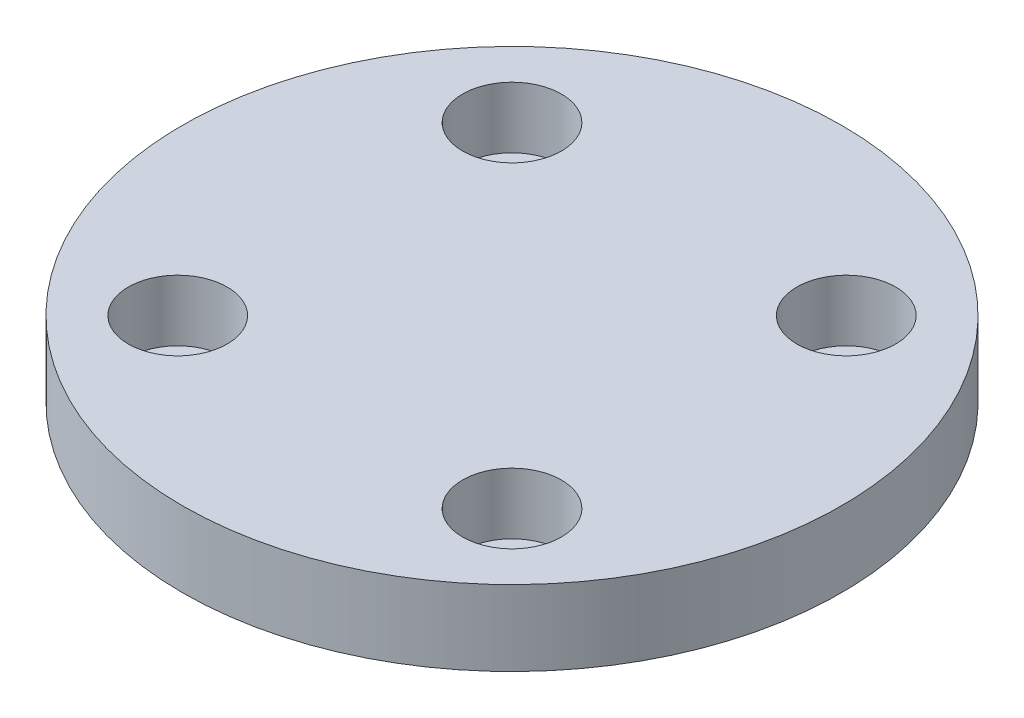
ISO-10303-21;
HEADER;
FILE_DESCRIPTION(('STEP AP214'),'2;1');
FILE_NAME('part.step','',(''),(''),'','','');
FILE_SCHEMA(('AUTOMOTIVE_DESIGN { 1 0 10303 214 1 1 1 1 }'));
ENDSEC;
DATA;
#1=APPLICATION_CONTEXT('core data for automotive mechanical design processes');
#2=APPLICATION_PROTOCOL_DEFINITION('international standard','automotive_design',2000,#1);
#3=PRODUCT_CONTEXT('',#1,'mechanical');
#4=PRODUCT('Part','Part','',(#3));
#5=PRODUCT_RELATED_PRODUCT_CATEGORY('part','',(#4));
#6=PRODUCT_DEFINITION_FORMATION('','',#4);
#7=PRODUCT_DEFINITION_CONTEXT('part definition',#1,'design');
#8=PRODUCT_DEFINITION('design','',#6,#7);
#9=PRODUCT_DEFINITION_SHAPE('','',#8);
#10=(LENGTH_UNIT() NAMED_UNIT(*) SI_UNIT(.MILLI.,.METRE.));
#11=(NAMED_UNIT(*) PLANE_ANGLE_UNIT() SI_UNIT($,.RADIAN.));
#12=(NAMED_UNIT(*) SI_UNIT($,.STERADIAN.) SOLID_ANGLE_UNIT());
#13=UNCERTAINTY_MEASURE_WITH_UNIT(LENGTH_MEASURE(1.E-05),#10,'distance_accuracy_value','');
#14=(GEOMETRIC_REPRESENTATION_CONTEXT(3) GLOBAL_UNCERTAINTY_ASSIGNED_CONTEXT((#13)) GLOBAL_UNIT_ASSIGNED_CONTEXT((#10,
#11,#12)) REPRESENTATION_CONTEXT('',''));
#15=CARTESIAN_POINT('',(0.,0.,0.));
#16=DIRECTION('',(0.,0.,1.));
#17=DIRECTION('',(1.,0.,0.));
#18=AXIS2_PLACEMENT_3D('',#15,#16,#17);
#19=CARTESIAN_POINT('',(0.,8.,0.));
#20=DIRECTION('',(0.,-1.,0.));
#21=DIRECTION('',(0.,0.,-1.));
#22=AXIS2_PLACEMENT_3D('',#19,#20,#21);
#23=CYLINDRICAL_SURFACE('',#22,35.);
#24=CARTESIAN_POINT('',(0.,8.,0.));
#25=DIRECTION('',(0.,1.,0.));
#26=DIRECTION('',(0.,0.,1.));
#27=AXIS2_PLACEMENT_3D('',#24,#25,#26);
#28=CIRCLE('',#27,35.);
#29=CARTESIAN_POINT('',(0.,8.,35.));
#30=VERTEX_POINT('',#29);
#31=EDGE_CURVE('E10',#30,#30,#28,.T.);
#32=ORIENTED_EDGE('',*,*,#31,.F.);
#33=EDGE_LOOP('',(#32));
#34=FACE_BOUND('',#33,.T.);
#35=CARTESIAN_POINT('',(0.,0.,0.));
#36=DIRECTION('',(0.,1.,0.));
#37=DIRECTION('',(0.,0.,1.));
#38=AXIS2_PLACEMENT_3D('',#35,#36,#37);
#39=CIRCLE('',#38,35.);
#40=CARTESIAN_POINT('',(0.,0.,35.));
#41=VERTEX_POINT('',#40);
#42=EDGE_CURVE('E36',#41,#41,#39,.T.);
#43=ORIENTED_EDGE('',*,*,#42,.T.);
#44=EDGE_LOOP('',(#43));
#45=FACE_BOUND('',#44,.T.);
#46=ADVANCED_FACE('F33',(#34,#45),#23,.T.);
#47=CARTESIAN_POINT('',(0.,8.,0.));
#48=DIRECTION('',(0.,1.,0.));
#49=DIRECTION('',(0.,0.,1.));
#50=AXIS2_PLACEMENT_3D('',#47,#48,#49);
#51=PLANE('',#50);
#52=CARTESIAN_POINT('',(-17.75,8.,17.75));
#53=DIRECTION('',(0.,1.,0.));
#54=DIRECTION('',(0.,0.,1.));
#55=AXIS2_PLACEMENT_3D('',#52,#53,#54);
#56=CIRCLE('',#55,5.25);
#57=CARTESIAN_POINT('',(-17.75,8.,23.));
#58=VERTEX_POINT('',#57);
#59=EDGE_CURVE('E63',#58,#58,#56,.T.);
#60=ORIENTED_EDGE('',*,*,#59,.F.);
#61=EDGE_LOOP('',(#60));
#62=FACE_BOUND('',#61,.T.);
#63=CARTESIAN_POINT('',(17.75,8.,17.75));
#64=DIRECTION('',(0.,1.,0.));
#65=DIRECTION('',(0.,0.,1.));
#66=AXIS2_PLACEMENT_3D('',#63,#64,#65);
#67=CIRCLE('',#66,5.25);
#68=CARTESIAN_POINT('',(17.75,8.,23.));
#69=VERTEX_POINT('',#68);
#70=EDGE_CURVE('E57',#69,#69,#67,.T.);
#71=ORIENTED_EDGE('',*,*,#70,.F.);
#72=EDGE_LOOP('',(#71));
#73=FACE_BOUND('',#72,.T.);
#74=CARTESIAN_POINT('',(17.75,8.,-17.75));
#75=DIRECTION('',(0.,1.,0.));
#76=DIRECTION('',(0.,0.,1.));
#77=AXIS2_PLACEMENT_3D('',#74,#75,#76);
#78=CIRCLE('',#77,5.25);
#79=CARTESIAN_POINT('',(17.75,8.,-12.5));
#80=VERTEX_POINT('',#79);
#81=EDGE_CURVE('E51',#80,#80,#78,.T.);
#82=ORIENTED_EDGE('',*,*,#81,.F.);
#83=EDGE_LOOP('',(#82));
#84=FACE_BOUND('',#83,.T.);
#85=CARTESIAN_POINT('',(-17.75,8.,-17.75));
#86=DIRECTION('',(0.,1.,0.));
#87=DIRECTION('',(0.,0.,1.));
#88=AXIS2_PLACEMENT_3D('',#85,#86,#87);
#89=CIRCLE('',#88,5.25);
#90=CARTESIAN_POINT('',(-17.75,8.,-12.5));
#91=VERTEX_POINT('',#90);
#92=EDGE_CURVE('E45',#91,#91,#89,.T.);
#93=ORIENTED_EDGE('',*,*,#92,.F.);
#94=EDGE_LOOP('',(#93));
#95=FACE_BOUND('',#94,.T.);
#96=ORIENTED_EDGE('',*,*,#31,.T.);
#97=EDGE_LOOP('',(#96));
#98=FACE_BOUND('',#97,.T.);
#99=ADVANCED_FACE('F110',(#62,#73,#84,#95,#98),#51,.T.);
#100=CARTESIAN_POINT('',(0.,0.,0.));
#101=DIRECTION('',(0.,1.,0.));
#102=DIRECTION('',(0.,0.,1.));
#103=AXIS2_PLACEMENT_3D('',#100,#101,#102);
#104=PLANE('',#103);
#105=CARTESIAN_POINT('',(17.75,0.,17.75));
#106=DIRECTION('',(0.,1.,0.));
#107=DIRECTION('',(0.,0.,1.));
#108=AXIS2_PLACEMENT_3D('',#105,#106,#107);
#109=CIRCLE('',#108,3.25);
#110=CARTESIAN_POINT('',(17.75,0.,21.));
#111=VERTEX_POINT('',#110);
#112=EDGE_CURVE('E86',#111,#111,#109,.T.);
#113=ORIENTED_EDGE('',*,*,#112,.T.);
#114=EDGE_LOOP('',(#113));
#115=FACE_BOUND('',#114,.T.);
#116=CARTESIAN_POINT('',(-17.75,0.,17.75));
#117=DIRECTION('',(0.,1.,0.));
#118=DIRECTION('',(0.,0.,1.));
#119=AXIS2_PLACEMENT_3D('',#116,#117,#118);
#120=CIRCLE('',#119,3.25);
#121=CARTESIAN_POINT('',(-17.75,0.,21.));
#122=VERTEX_POINT('',#121);
#123=EDGE_CURVE('E80',#122,#122,#120,.T.);
#124=ORIENTED_EDGE('',*,*,#123,.T.);
#125=EDGE_LOOP('',(#124));
#126=FACE_BOUND('',#125,.T.);
#127=CARTESIAN_POINT('',(-17.75,0.,-17.75));
#128=DIRECTION('',(0.,1.,0.));
#129=DIRECTION('',(0.,0.,1.));
#130=AXIS2_PLACEMENT_3D('',#127,#128,#129);
#131=CIRCLE('',#130,3.25);
#132=CARTESIAN_POINT('',(-17.75,0.,-14.5));
#133=VERTEX_POINT('',#132);
#134=EDGE_CURVE('E74',#133,#133,#131,.T.);
#135=ORIENTED_EDGE('',*,*,#134,.T.);
#136=EDGE_LOOP('',(#135));
#137=FACE_BOUND('',#136,.T.);
#138=CARTESIAN_POINT('',(17.75,0.,-17.75));
#139=DIRECTION('',(0.,1.,0.));
#140=DIRECTION('',(0.,0.,1.));
#141=AXIS2_PLACEMENT_3D('',#138,#139,#140);
#142=CIRCLE('',#141,3.25);
#143=CARTESIAN_POINT('',(17.75,0.,-14.5));
#144=VERTEX_POINT('',#143);
#145=EDGE_CURVE('E66',#144,#144,#142,.T.);
#146=ORIENTED_EDGE('',*,*,#145,.T.);
#147=EDGE_LOOP('',(#146));
#148=FACE_BOUND('',#147,.T.);
#149=ORIENTED_EDGE('',*,*,#42,.F.);
#150=EDGE_LOOP('',(#149));
#151=FACE_BOUND('',#150,.T.);
#152=ADVANCED_FACE('F113',(#115,#126,#137,#148,#151),#104,.F.);
#153=CARTESIAN_POINT('',(-17.75,1.5,-17.75));
#154=DIRECTION('',(0.,1.,0.));
#155=DIRECTION('',(0.,0.,1.));
#156=AXIS2_PLACEMENT_3D('',#153,#154,#155);
#157=CYLINDRICAL_SURFACE('',#156,5.25);
#158=CARTESIAN_POINT('',(-17.75,1.5,-17.75));
#159=DIRECTION('',(0.,1.,0.));
#160=DIRECTION('',(0.,0.,1.));
#161=AXIS2_PLACEMENT_3D('',#158,#159,#160);
#162=CIRCLE('',#161,5.25);
#163=CARTESIAN_POINT('',(-17.75,1.5,-12.5));
#164=VERTEX_POINT('',#163);
#165=EDGE_CURVE('E43',#164,#164,#162,.T.);
#166=CARTESIAN_POINT('',(-17.75,1.5,-12.5));
#167=CARTESIAN_POINT('',(-17.75,1.56770833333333,-12.5));
#168=CARTESIAN_POINT('',(-17.75,1.63541666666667,-12.5));
#169=CARTESIAN_POINT('',(-17.75,1.77083333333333,-12.5));
#170=CARTESIAN_POINT('',(-17.75,1.83854166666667,-12.5));
#171=CARTESIAN_POINT('',(-17.75,1.97395833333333,-12.5));
#172=CARTESIAN_POINT('',(-17.75,2.04166666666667,-12.5));
#173=CARTESIAN_POINT('',(-17.75,2.17708333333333,-12.5));
#174=CARTESIAN_POINT('',(-17.75,2.24479166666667,-12.5));
#175=CARTESIAN_POINT('',(-17.75,2.38020833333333,-12.5));
#176=CARTESIAN_POINT('',(-17.75,2.44791666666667,-12.5));
#177=CARTESIAN_POINT('',(-17.75,2.58333333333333,-12.5));
#178=CARTESIAN_POINT('',(-17.75,2.65104166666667,-12.5));
#179=CARTESIAN_POINT('',(-17.75,2.78645833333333,-12.5));
#180=CARTESIAN_POINT('',(-17.75,2.85416666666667,-12.5));
#181=CARTESIAN_POINT('',(-17.75,2.98958333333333,-12.5));
#182=CARTESIAN_POINT('',(-17.75,3.05729166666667,-12.5));
#183=CARTESIAN_POINT('',(-17.75,3.19270833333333,-12.5));
#184=CARTESIAN_POINT('',(-17.75,3.26041666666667,-12.5));
#185=CARTESIAN_POINT('',(-17.75,3.39583333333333,-12.5));
#186=CARTESIAN_POINT('',(-17.75,3.46354166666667,-12.5));
#187=CARTESIAN_POINT('',(-17.75,3.59895833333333,-12.5));
#188=CARTESIAN_POINT('',(-17.75,3.66666666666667,-12.5));
#189=CARTESIAN_POINT('',(-17.75,3.80208333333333,-12.5));
#190=CARTESIAN_POINT('',(-17.75,3.86979166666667,-12.5));
#191=CARTESIAN_POINT('',(-17.75,4.00520833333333,-12.5));
#192=CARTESIAN_POINT('',(-17.75,4.07291666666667,-12.5));
#193=CARTESIAN_POINT('',(-17.75,4.20833333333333,-12.5));
#194=CARTESIAN_POINT('',(-17.75,4.27604166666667,-12.5));
#195=CARTESIAN_POINT('',(-17.75,4.41145833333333,-12.5));
#196=CARTESIAN_POINT('',(-17.75,4.47916666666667,-12.5));
#197=CARTESIAN_POINT('',(-17.75,4.61458333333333,-12.5));
#198=CARTESIAN_POINT('',(-17.75,4.68229166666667,-12.5));
#199=CARTESIAN_POINT('',(-17.75,4.81770833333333,-12.5));
#200=CARTESIAN_POINT('',(-17.75,4.88541666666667,-12.5));
#201=CARTESIAN_POINT('',(-17.75,5.02083333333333,-12.5));
#202=CARTESIAN_POINT('',(-17.75,5.08854166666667,-12.5));
#203=CARTESIAN_POINT('',(-17.75,5.22395833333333,-12.5));
#204=CARTESIAN_POINT('',(-17.75,5.29166666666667,-12.5));
#205=CARTESIAN_POINT('',(-17.75,5.42708333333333,-12.5));
#206=CARTESIAN_POINT('',(-17.75,5.49479166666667,-12.5));
#207=CARTESIAN_POINT('',(-17.75,5.63020833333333,-12.5));
#208=CARTESIAN_POINT('',(-17.75,5.69791666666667,-12.5));
#209=CARTESIAN_POINT('',(-17.75,5.83333333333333,-12.5));
#210=CARTESIAN_POINT('',(-17.75,5.90104166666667,-12.5));
#211=CARTESIAN_POINT('',(-17.75,6.03645833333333,-12.5));
#212=CARTESIAN_POINT('',(-17.75,6.10416666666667,-12.5));
#213=CARTESIAN_POINT('',(-17.75,6.23958333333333,-12.5));
#214=CARTESIAN_POINT('',(-17.75,6.30729166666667,-12.5));
#215=CARTESIAN_POINT('',(-17.75,6.44270833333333,-12.5));
#216=CARTESIAN_POINT('',(-17.75,6.51041666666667,-12.5));
#217=CARTESIAN_POINT('',(-17.75,6.64583333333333,-12.5));
#218=CARTESIAN_POINT('',(-17.75,6.71354166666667,-12.5));
#219=CARTESIAN_POINT('',(-17.75,6.84895833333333,-12.5));
#220=CARTESIAN_POINT('',(-17.75,6.91666666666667,-12.5));
#221=CARTESIAN_POINT('',(-17.75,7.05208333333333,-12.5));
#222=CARTESIAN_POINT('',(-17.75,7.11979166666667,-12.5));
#223=CARTESIAN_POINT('',(-17.75,7.25520833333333,-12.5));
#224=CARTESIAN_POINT('',(-17.75,7.32291666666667,-12.5));
#225=CARTESIAN_POINT('',(-17.75,7.45833333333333,-12.5));
#226=CARTESIAN_POINT('',(-17.75,7.52604166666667,-12.5));
#227=CARTESIAN_POINT('',(-17.75,7.66145833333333,-12.5));
#228=CARTESIAN_POINT('',(-17.75,7.72916666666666,-12.5));
#229=CARTESIAN_POINT('',(-17.75,7.86458333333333,-12.5));
#230=CARTESIAN_POINT('',(-17.75,7.93229166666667,-12.5));
#231=CARTESIAN_POINT('',(-17.75,8.,-12.5));
#232=B_SPLINE_CURVE_WITH_KNOTS('',3,(#166,#167,#168,#169,#170,#171,#172,#173,#174,#175,#176,
#177,#178,#179,#180,#181,#182,#183,#184,#185,#186,#187,#188,#189,#190,#191,#192,#193,#194,#195,
#196,#197,#198,#199,#200,#201,#202,#203,#204,#205,#206,#207,#208,#209,#210,#211,#212,#213,#214,
#215,#216,#217,#218,#219,#220,#221,#222,#223,#224,#225,#226,#227,#228,#229,#230,#231),
.UNSPECIFIED.,.F.,.F.,(4,2,2,2,2,2,2,2,2,2,2,2,2,2,2,2,2,2,2,2,2,2,2,2,2,2,2,2,2,2,2,2,4),(0.,
0.203125,0.40625,0.609375,0.8125,1.015625,1.21875,1.421875,1.625,1.828125,2.03125,2.234375,
2.4375,2.640625,2.84375,3.046875,3.25,3.453125,3.65625,3.859375,4.0625,4.265625,4.46875,
4.671875,4.875,5.078125,5.28125,5.484375,5.6875,5.890625,6.09375,6.296875,6.5),.UNSPECIFIED.);
#233=EDGE_CURVE('BSEAM120',#164,#91,#232,.T.);
#234=ORIENTED_EDGE('',*,*,#165,.F.);
#235=ORIENTED_EDGE('',*,*,#92,.T.);
#236=ORIENTED_EDGE('',*,*,#233,.T.);
#237=ORIENTED_EDGE('',*,*,#233,.F.);
#238=EDGE_LOOP('',(#234,#236,#235,#237));
#239=FACE_BOUND('',#238,.T.);
#240=ADVANCED_FACE('F120',(#239),#157,.F.);
#241=CARTESIAN_POINT('',(-17.75,1.5,-17.75));
#242=DIRECTION('',(0.,1.,0.));
#243=DIRECTION('',(0.,0.,1.));
#244=AXIS2_PLACEMENT_3D('',#241,#242,#243);
#245=PLANE('',#244);
#246=CARTESIAN_POINT('',(-17.75,1.5,-17.75));
#247=DIRECTION('',(0.,1.,0.));
#248=DIRECTION('',(0.,0.,1.));
#249=AXIS2_PLACEMENT_3D('',#246,#247,#248);
#250=CIRCLE('',#249,3.25);
#251=CARTESIAN_POINT('',(-17.75,1.5,-14.5));
#252=VERTEX_POINT('',#251);
#253=EDGE_CURVE('E77',#252,#252,#250,.T.);
#254=ORIENTED_EDGE('',*,*,#253,.F.);
#255=EDGE_LOOP('',(#254));
#256=FACE_BOUND('',#255,.T.);
#257=ORIENTED_EDGE('',*,*,#165,.T.);
#258=EDGE_LOOP('',(#257));
#259=FACE_BOUND('',#258,.T.);
#260=ADVANCED_FACE('F122',(#256,#259),#245,.T.);
#261=CARTESIAN_POINT('',(17.75,1.5,-17.75));
#262=DIRECTION('',(0.,1.,0.));
#263=DIRECTION('',(0.,0.,1.));
#264=AXIS2_PLACEMENT_3D('',#261,#262,#263);
#265=CYLINDRICAL_SURFACE('',#264,5.25);
#266=CARTESIAN_POINT('',(17.75,1.5,-17.75));
#267=DIRECTION('',(0.,1.,0.));
#268=DIRECTION('',(0.,0.,1.));
#269=AXIS2_PLACEMENT_3D('',#266,#267,#268);
#270=CIRCLE('',#269,5.25);
#271=CARTESIAN_POINT('',(17.75,1.5,-12.5));
#272=VERTEX_POINT('',#271);
#273=EDGE_CURVE('E48',#272,#272,#270,.T.);
#274=CARTESIAN_POINT('',(17.75,1.5,-12.5));
#275=CARTESIAN_POINT('',(17.75,1.56770833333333,-12.5));
#276=CARTESIAN_POINT('',(17.75,1.63541666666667,-12.5));
#277=CARTESIAN_POINT('',(17.75,1.77083333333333,-12.5));
#278=CARTESIAN_POINT('',(17.75,1.83854166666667,-12.5));
#279=CARTESIAN_POINT('',(17.75,1.97395833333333,-12.5));
#280=CARTESIAN_POINT('',(17.75,2.04166666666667,-12.5));
#281=CARTESIAN_POINT('',(17.75,2.17708333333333,-12.5));
#282=CARTESIAN_POINT('',(17.75,2.24479166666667,-12.5));
#283=CARTESIAN_POINT('',(17.75,2.38020833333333,-12.5));
#284=CARTESIAN_POINT('',(17.75,2.44791666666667,-12.5));
#285=CARTESIAN_POINT('',(17.75,2.58333333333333,-12.5));
#286=CARTESIAN_POINT('',(17.75,2.65104166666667,-12.5));
#287=CARTESIAN_POINT('',(17.75,2.78645833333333,-12.5));
#288=CARTESIAN_POINT('',(17.75,2.85416666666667,-12.5));
#289=CARTESIAN_POINT('',(17.75,2.98958333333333,-12.5));
#290=CARTESIAN_POINT('',(17.75,3.05729166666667,-12.5));
#291=CARTESIAN_POINT('',(17.75,3.19270833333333,-12.5));
#292=CARTESIAN_POINT('',(17.75,3.26041666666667,-12.5));
#293=CARTESIAN_POINT('',(17.75,3.39583333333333,-12.5));
#294=CARTESIAN_POINT('',(17.75,3.46354166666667,-12.5));
#295=CARTESIAN_POINT('',(17.75,3.59895833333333,-12.5));
#296=CARTESIAN_POINT('',(17.75,3.66666666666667,-12.5));
#297=CARTESIAN_POINT('',(17.75,3.80208333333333,-12.5));
#298=CARTESIAN_POINT('',(17.75,3.86979166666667,-12.5));
#299=CARTESIAN_POINT('',(17.75,4.00520833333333,-12.5));
#300=CARTESIAN_POINT('',(17.75,4.07291666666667,-12.5));
#301=CARTESIAN_POINT('',(17.75,4.20833333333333,-12.5));
#302=CARTESIAN_POINT('',(17.75,4.27604166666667,-12.5));
#303=CARTESIAN_POINT('',(17.75,4.41145833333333,-12.5));
#304=CARTESIAN_POINT('',(17.75,4.47916666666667,-12.5));
#305=CARTESIAN_POINT('',(17.75,4.61458333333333,-12.5));
#306=CARTESIAN_POINT('',(17.75,4.68229166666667,-12.5));
#307=CARTESIAN_POINT('',(17.75,4.81770833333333,-12.5));
#308=CARTESIAN_POINT('',(17.75,4.88541666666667,-12.5));
#309=CARTESIAN_POINT('',(17.75,5.02083333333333,-12.5));
#310=CARTESIAN_POINT('',(17.75,5.08854166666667,-12.5));
#311=CARTESIAN_POINT('',(17.75,5.22395833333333,-12.5));
#312=CARTESIAN_POINT('',(17.75,5.29166666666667,-12.5));
#313=CARTESIAN_POINT('',(17.75,5.42708333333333,-12.5));
#314=CARTESIAN_POINT('',(17.75,5.49479166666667,-12.5));
#315=CARTESIAN_POINT('',(17.75,5.63020833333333,-12.5));
#316=CARTESIAN_POINT('',(17.75,5.69791666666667,-12.5));
#317=CARTESIAN_POINT('',(17.75,5.83333333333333,-12.5));
#318=CARTESIAN_POINT('',(17.75,5.90104166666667,-12.5));
#319=CARTESIAN_POINT('',(17.75,6.03645833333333,-12.5));
#320=CARTESIAN_POINT('',(17.75,6.10416666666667,-12.5));
#321=CARTESIAN_POINT('',(17.75,6.23958333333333,-12.5));
#322=CARTESIAN_POINT('',(17.75,6.30729166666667,-12.5));
#323=CARTESIAN_POINT('',(17.75,6.44270833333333,-12.5));
#324=CARTESIAN_POINT('',(17.75,6.51041666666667,-12.5));
#325=CARTESIAN_POINT('',(17.75,6.64583333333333,-12.5));
#326=CARTESIAN_POINT('',(17.75,6.71354166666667,-12.5));
#327=CARTESIAN_POINT('',(17.75,6.84895833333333,-12.5));
#328=CARTESIAN_POINT('',(17.75,6.91666666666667,-12.5));
#329=CARTESIAN_POINT('',(17.75,7.05208333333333,-12.5));
#330=CARTESIAN_POINT('',(17.75,7.11979166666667,-12.5));
#331=CARTESIAN_POINT('',(17.75,7.25520833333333,-12.5));
#332=CARTESIAN_POINT('',(17.75,7.32291666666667,-12.5));
#333=CARTESIAN_POINT('',(17.75,7.45833333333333,-12.5));
#334=CARTESIAN_POINT('',(17.75,7.52604166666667,-12.5));
#335=CARTESIAN_POINT('',(17.75,7.66145833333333,-12.5));
#336=CARTESIAN_POINT('',(17.75,7.72916666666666,-12.5));
#337=CARTESIAN_POINT('',(17.75,7.86458333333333,-12.5));
#338=CARTESIAN_POINT('',(17.75,7.93229166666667,-12.5));
#339=CARTESIAN_POINT('',(17.75,8.,-12.5));
#340=B_SPLINE_CURVE_WITH_KNOTS('',3,(#274,#275,#276,#277,#278,#279,#280,#281,#282,#283,#284,
#285,#286,#287,#288,#289,#290,#291,#292,#293,#294,#295,#296,#297,#298,#299,#300,#301,#302,#303,
#304,#305,#306,#307,#308,#309,#310,#311,#312,#313,#314,#315,#316,#317,#318,#319,#320,#321,#322,
#323,#324,#325,#326,#327,#328,#329,#330,#331,#332,#333,#334,#335,#336,#337,#338,#339),
.UNSPECIFIED.,.F.,.F.,(4,2,2,2,2,2,2,2,2,2,2,2,2,2,2,2,2,2,2,2,2,2,2,2,2,2,2,2,2,2,2,2,4),(0.,
0.203125,0.40625,0.609375,0.8125,1.015625,1.21875,1.421875,1.625,1.828125,2.03125,2.234375,
2.4375,2.640625,2.84375,3.046875,3.25,3.453125,3.65625,3.859375,4.0625,4.265625,4.46875,
4.671875,4.875,5.078125,5.28125,5.484375,5.6875,5.890625,6.09375,6.296875,6.5),.UNSPECIFIED.);
#341=EDGE_CURVE('BSEAM129',#272,#80,#340,.T.);
#342=ORIENTED_EDGE('',*,*,#273,.F.);
#343=ORIENTED_EDGE('',*,*,#81,.T.);
#344=ORIENTED_EDGE('',*,*,#341,.T.);
#345=ORIENTED_EDGE('',*,*,#341,.F.);
#346=EDGE_LOOP('',(#342,#344,#343,#345));
#347=FACE_BOUND('',#346,.T.);
#348=ADVANCED_FACE('F129',(#347),#265,.F.);
#349=CARTESIAN_POINT('',(17.75,1.5,-17.75));
#350=DIRECTION('',(0.,1.,0.));
#351=DIRECTION('',(0.,0.,1.));
#352=AXIS2_PLACEMENT_3D('',#349,#350,#351);
#353=PLANE('',#352);
#354=CARTESIAN_POINT('',(17.75,1.5,-17.75));
#355=DIRECTION('',(0.,1.,0.));
#356=DIRECTION('',(0.,0.,1.));
#357=AXIS2_PLACEMENT_3D('',#354,#355,#356);
#358=CIRCLE('',#357,3.25);
#359=CARTESIAN_POINT('',(17.75,1.5,-14.5));
#360=VERTEX_POINT('',#359);
#361=EDGE_CURVE('E71',#360,#360,#358,.T.);
#362=ORIENTED_EDGE('',*,*,#361,.F.);
#363=EDGE_LOOP('',(#362));
#364=FACE_BOUND('',#363,.T.);
#365=ORIENTED_EDGE('',*,*,#273,.T.);
#366=EDGE_LOOP('',(#365));
#367=FACE_BOUND('',#366,.T.);
#368=ADVANCED_FACE('F106',(#364,#367),#353,.T.);
#369=CARTESIAN_POINT('',(17.75,1.5,17.75));
#370=DIRECTION('',(0.,1.,0.));
#371=DIRECTION('',(0.,0.,1.));
#372=AXIS2_PLACEMENT_3D('',#369,#370,#371);
#373=CYLINDRICAL_SURFACE('',#372,5.25);
#374=CARTESIAN_POINT('',(17.75,1.5,17.75));
#375=DIRECTION('',(0.,1.,0.));
#376=DIRECTION('',(0.,0.,1.));
#377=AXIS2_PLACEMENT_3D('',#374,#375,#376);
#378=CIRCLE('',#377,5.25);
#379=CARTESIAN_POINT('',(17.75,1.5,23.));
#380=VERTEX_POINT('',#379);
#381=EDGE_CURVE('E54',#380,#380,#378,.T.);
#382=CARTESIAN_POINT('',(17.75,1.5,23.));
#383=CARTESIAN_POINT('',(17.75,1.56770833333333,23.));
#384=CARTESIAN_POINT('',(17.75,1.63541666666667,23.));
#385=CARTESIAN_POINT('',(17.75,1.77083333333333,23.));
#386=CARTESIAN_POINT('',(17.75,1.83854166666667,23.));
#387=CARTESIAN_POINT('',(17.75,1.97395833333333,23.));
#388=CARTESIAN_POINT('',(17.75,2.04166666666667,23.));
#389=CARTESIAN_POINT('',(17.75,2.17708333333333,23.));
#390=CARTESIAN_POINT('',(17.75,2.24479166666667,23.));
#391=CARTESIAN_POINT('',(17.75,2.38020833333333,23.));
#392=CARTESIAN_POINT('',(17.75,2.44791666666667,23.));
#393=CARTESIAN_POINT('',(17.75,2.58333333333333,23.));
#394=CARTESIAN_POINT('',(17.75,2.65104166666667,23.));
#395=CARTESIAN_POINT('',(17.75,2.78645833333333,23.));
#396=CARTESIAN_POINT('',(17.75,2.85416666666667,23.));
#397=CARTESIAN_POINT('',(17.75,2.98958333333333,23.));
#398=CARTESIAN_POINT('',(17.75,3.05729166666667,23.));
#399=CARTESIAN_POINT('',(17.75,3.19270833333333,23.));
#400=CARTESIAN_POINT('',(17.75,3.26041666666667,23.));
#401=CARTESIAN_POINT('',(17.75,3.39583333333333,23.));
#402=CARTESIAN_POINT('',(17.75,3.46354166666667,23.));
#403=CARTESIAN_POINT('',(17.75,3.59895833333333,23.));
#404=CARTESIAN_POINT('',(17.75,3.66666666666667,23.));
#405=CARTESIAN_POINT('',(17.75,3.80208333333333,23.));
#406=CARTESIAN_POINT('',(17.75,3.86979166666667,23.));
#407=CARTESIAN_POINT('',(17.75,4.00520833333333,23.));
#408=CARTESIAN_POINT('',(17.75,4.07291666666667,23.));
#409=CARTESIAN_POINT('',(17.75,4.20833333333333,23.));
#410=CARTESIAN_POINT('',(17.75,4.27604166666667,23.));
#411=CARTESIAN_POINT('',(17.75,4.41145833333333,23.));
#412=CARTESIAN_POINT('',(17.75,4.47916666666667,23.));
#413=CARTESIAN_POINT('',(17.75,4.61458333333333,23.));
#414=CARTESIAN_POINT('',(17.75,4.68229166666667,23.));
#415=CARTESIAN_POINT('',(17.75,4.81770833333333,23.));
#416=CARTESIAN_POINT('',(17.75,4.88541666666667,23.));
#417=CARTESIAN_POINT('',(17.75,5.02083333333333,23.));
#418=CARTESIAN_POINT('',(17.75,5.08854166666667,23.));
#419=CARTESIAN_POINT('',(17.75,5.22395833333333,23.));
#420=CARTESIAN_POINT('',(17.75,5.29166666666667,23.));
#421=CARTESIAN_POINT('',(17.75,5.42708333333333,23.));
#422=CARTESIAN_POINT('',(17.75,5.49479166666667,23.));
#423=CARTESIAN_POINT('',(17.75,5.63020833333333,23.));
#424=CARTESIAN_POINT('',(17.75,5.69791666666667,23.));
#425=CARTESIAN_POINT('',(17.75,5.83333333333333,23.));
#426=CARTESIAN_POINT('',(17.75,5.90104166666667,23.));
#427=CARTESIAN_POINT('',(17.75,6.03645833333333,23.));
#428=CARTESIAN_POINT('',(17.75,6.10416666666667,23.));
#429=CARTESIAN_POINT('',(17.75,6.23958333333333,23.));
#430=CARTESIAN_POINT('',(17.75,6.30729166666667,23.));
#431=CARTESIAN_POINT('',(17.75,6.44270833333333,23.));
#432=CARTESIAN_POINT('',(17.75,6.51041666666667,23.));
#433=CARTESIAN_POINT('',(17.75,6.64583333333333,23.));
#434=CARTESIAN_POINT('',(17.75,6.71354166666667,23.));
#435=CARTESIAN_POINT('',(17.75,6.84895833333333,23.));
#436=CARTESIAN_POINT('',(17.75,6.91666666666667,23.));
#437=CARTESIAN_POINT('',(17.75,7.05208333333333,23.));
#438=CARTESIAN_POINT('',(17.75,7.11979166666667,23.));
#439=CARTESIAN_POINT('',(17.75,7.25520833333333,23.));
#440=CARTESIAN_POINT('',(17.75,7.32291666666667,23.));
#441=CARTESIAN_POINT('',(17.75,7.45833333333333,23.));
#442=CARTESIAN_POINT('',(17.75,7.52604166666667,23.));
#443=CARTESIAN_POINT('',(17.75,7.66145833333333,23.));
#444=CARTESIAN_POINT('',(17.75,7.72916666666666,23.));
#445=CARTESIAN_POINT('',(17.75,7.86458333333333,23.));
#446=CARTESIAN_POINT('',(17.75,7.93229166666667,23.));
#447=CARTESIAN_POINT('',(17.75,8.,23.));
#448=B_SPLINE_CURVE_WITH_KNOTS('',3,(#382,#383,#384,#385,#386,#387,#388,#389,#390,#391,#392,
#393,#394,#395,#396,#397,#398,#399,#400,#401,#402,#403,#404,#405,#406,#407,#408,#409,#410,#411,
#412,#413,#414,#415,#416,#417,#418,#419,#420,#421,#422,#423,#424,#425,#426,#427,#428,#429,#430,
#431,#432,#433,#434,#435,#436,#437,#438,#439,#440,#441,#442,#443,#444,#445,#446,#447),
.UNSPECIFIED.,.F.,.F.,(4,2,2,2,2,2,2,2,2,2,2,2,2,2,2,2,2,2,2,2,2,2,2,2,2,2,2,2,2,2,2,2,4),(0.,
0.203125,0.40625,0.609375,0.8125,1.015625,1.21875,1.421875,1.625,1.828125,2.03125,2.234375,
2.4375,2.640625,2.84375,3.046875,3.25,3.453125,3.65625,3.859375,4.0625,4.265625,4.46875,
4.671875,4.875,5.078125,5.28125,5.484375,5.6875,5.890625,6.09375,6.296875,6.5),.UNSPECIFIED.);
#449=EDGE_CURVE('BSEAM100',#380,#69,#448,.T.);
#450=ORIENTED_EDGE('',*,*,#381,.F.);
#451=ORIENTED_EDGE('',*,*,#70,.T.);
#452=ORIENTED_EDGE('',*,*,#449,.T.);
#453=ORIENTED_EDGE('',*,*,#449,.F.);
#454=EDGE_LOOP('',(#450,#452,#451,#453));
#455=FACE_BOUND('',#454,.T.);
#456=ADVANCED_FACE('F100',(#455),#373,.F.);
#457=CARTESIAN_POINT('',(17.75,1.5,17.75));
#458=DIRECTION('',(0.,1.,0.));
#459=DIRECTION('',(0.,0.,1.));
#460=AXIS2_PLACEMENT_3D('',#457,#458,#459);
#461=PLANE('',#460);
#462=CARTESIAN_POINT('',(17.75,1.5,17.75));
#463=DIRECTION('',(0.,1.,0.));
#464=DIRECTION('',(0.,0.,1.));
#465=AXIS2_PLACEMENT_3D('',#462,#463,#464);
#466=CIRCLE('',#465,3.25);
#467=CARTESIAN_POINT('',(17.75,1.5,21.));
#468=VERTEX_POINT('',#467);
#469=EDGE_CURVE('E89',#468,#468,#466,.T.);
#470=ORIENTED_EDGE('',*,*,#469,.F.);
#471=EDGE_LOOP('',(#470));
#472=FACE_BOUND('',#471,.T.);
#473=ORIENTED_EDGE('',*,*,#381,.T.);
#474=EDGE_LOOP('',(#473));
#475=FACE_BOUND('',#474,.T.);
#476=ADVANCED_FACE('F96',(#472,#475),#461,.T.);
#477=CARTESIAN_POINT('',(-17.75,1.5,17.75));
#478=DIRECTION('',(0.,1.,0.));
#479=DIRECTION('',(0.,0.,1.));
#480=AXIS2_PLACEMENT_3D('',#477,#478,#479);
#481=CYLINDRICAL_SURFACE('',#480,5.25);
#482=CARTESIAN_POINT('',(-17.75,1.5,17.75));
#483=DIRECTION('',(0.,1.,0.));
#484=DIRECTION('',(0.,0.,1.));
#485=AXIS2_PLACEMENT_3D('',#482,#483,#484);
#486=CIRCLE('',#485,5.25);
#487=CARTESIAN_POINT('',(-17.75,1.5,23.));
#488=VERTEX_POINT('',#487);
#489=EDGE_CURVE('E60',#488,#488,#486,.T.);
#490=CARTESIAN_POINT('',(-17.75,1.5,23.));
#491=CARTESIAN_POINT('',(-17.75,1.56770833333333,23.));
#492=CARTESIAN_POINT('',(-17.75,1.63541666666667,23.));
#493=CARTESIAN_POINT('',(-17.75,1.77083333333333,23.));
#494=CARTESIAN_POINT('',(-17.75,1.83854166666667,23.));
#495=CARTESIAN_POINT('',(-17.75,1.97395833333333,23.));
#496=CARTESIAN_POINT('',(-17.75,2.04166666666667,23.));
#497=CARTESIAN_POINT('',(-17.75,2.17708333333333,23.));
#498=CARTESIAN_POINT('',(-17.75,2.24479166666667,23.));
#499=CARTESIAN_POINT('',(-17.75,2.38020833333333,23.));
#500=CARTESIAN_POINT('',(-17.75,2.44791666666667,23.));
#501=CARTESIAN_POINT('',(-17.75,2.58333333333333,23.));
#502=CARTESIAN_POINT('',(-17.75,2.65104166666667,23.));
#503=CARTESIAN_POINT('',(-17.75,2.78645833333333,23.));
#504=CARTESIAN_POINT('',(-17.75,2.85416666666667,23.));
#505=CARTESIAN_POINT('',(-17.75,2.98958333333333,23.));
#506=CARTESIAN_POINT('',(-17.75,3.05729166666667,23.));
#507=CARTESIAN_POINT('',(-17.75,3.19270833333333,23.));
#508=CARTESIAN_POINT('',(-17.75,3.26041666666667,23.));
#509=CARTESIAN_POINT('',(-17.75,3.39583333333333,23.));
#510=CARTESIAN_POINT('',(-17.75,3.46354166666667,23.));
#511=CARTESIAN_POINT('',(-17.75,3.59895833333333,23.));
#512=CARTESIAN_POINT('',(-17.75,3.66666666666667,23.));
#513=CARTESIAN_POINT('',(-17.75,3.80208333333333,23.));
#514=CARTESIAN_POINT('',(-17.75,3.86979166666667,23.));
#515=CARTESIAN_POINT('',(-17.75,4.00520833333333,23.));
#516=CARTESIAN_POINT('',(-17.75,4.07291666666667,23.));
#517=CARTESIAN_POINT('',(-17.75,4.20833333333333,23.));
#518=CARTESIAN_POINT('',(-17.75,4.27604166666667,23.));
#519=CARTESIAN_POINT('',(-17.75,4.41145833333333,23.));
#520=CARTESIAN_POINT('',(-17.75,4.47916666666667,23.));
#521=CARTESIAN_POINT('',(-17.75,4.61458333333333,23.));
#522=CARTESIAN_POINT('',(-17.75,4.68229166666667,23.));
#523=CARTESIAN_POINT('',(-17.75,4.81770833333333,23.));
#524=CARTESIAN_POINT('',(-17.75,4.88541666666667,23.));
#525=CARTESIAN_POINT('',(-17.75,5.02083333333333,23.));
#526=CARTESIAN_POINT('',(-17.75,5.08854166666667,23.));
#527=CARTESIAN_POINT('',(-17.75,5.22395833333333,23.));
#528=CARTESIAN_POINT('',(-17.75,5.29166666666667,23.));
#529=CARTESIAN_POINT('',(-17.75,5.42708333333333,23.));
#530=CARTESIAN_POINT('',(-17.75,5.49479166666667,23.));
#531=CARTESIAN_POINT('',(-17.75,5.63020833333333,23.));
#532=CARTESIAN_POINT('',(-17.75,5.69791666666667,23.));
#533=CARTESIAN_POINT('',(-17.75,5.83333333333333,23.));
#534=CARTESIAN_POINT('',(-17.75,5.90104166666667,23.));
#535=CARTESIAN_POINT('',(-17.75,6.03645833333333,23.));
#536=CARTESIAN_POINT('',(-17.75,6.10416666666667,23.));
#537=CARTESIAN_POINT('',(-17.75,6.23958333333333,23.));
#538=CARTESIAN_POINT('',(-17.75,6.30729166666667,23.));
#539=CARTESIAN_POINT('',(-17.75,6.44270833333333,23.));
#540=CARTESIAN_POINT('',(-17.75,6.51041666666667,23.));
#541=CARTESIAN_POINT('',(-17.75,6.64583333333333,23.));
#542=CARTESIAN_POINT('',(-17.75,6.71354166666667,23.));
#543=CARTESIAN_POINT('',(-17.75,6.84895833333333,23.));
#544=CARTESIAN_POINT('',(-17.75,6.91666666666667,23.));
#545=CARTESIAN_POINT('',(-17.75,7.05208333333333,23.));
#546=CARTESIAN_POINT('',(-17.75,7.11979166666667,23.));
#547=CARTESIAN_POINT('',(-17.75,7.25520833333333,23.));
#548=CARTESIAN_POINT('',(-17.75,7.32291666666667,23.));
#549=CARTESIAN_POINT('',(-17.75,7.45833333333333,23.));
#550=CARTESIAN_POINT('',(-17.75,7.52604166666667,23.));
#551=CARTESIAN_POINT('',(-17.75,7.66145833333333,23.));
#552=CARTESIAN_POINT('',(-17.75,7.72916666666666,23.));
#553=CARTESIAN_POINT('',(-17.75,7.86458333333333,23.));
#554=CARTESIAN_POINT('',(-17.75,7.93229166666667,23.));
#555=CARTESIAN_POINT('',(-17.75,8.,23.));
#556=B_SPLINE_CURVE_WITH_KNOTS('',3,(#490,#491,#492,#493,#494,#495,#496,#497,#498,#499,#500,
#501,#502,#503,#504,#505,#506,#507,#508,#509,#510,#511,#512,#513,#514,#515,#516,#517,#518,#519,
#520,#521,#522,#523,#524,#525,#526,#527,#528,#529,#530,#531,#532,#533,#534,#535,#536,#537,#538,
#539,#540,#541,#542,#543,#544,#545,#546,#547,#548,#549,#550,#551,#552,#553,#554,#555),
.UNSPECIFIED.,.F.,.F.,(4,2,2,2,2,2,2,2,2,2,2,2,2,2,2,2,2,2,2,2,2,2,2,2,2,2,2,2,2,2,2,2,4),(0.,
0.203125,0.40625,0.609375,0.8125,1.015625,1.21875,1.421875,1.625,1.828125,2.03125,2.234375,
2.4375,2.640625,2.84375,3.046875,3.25,3.453125,3.65625,3.859375,4.0625,4.265625,4.46875,
4.671875,4.875,5.078125,5.28125,5.484375,5.6875,5.890625,6.09375,6.296875,6.5),.UNSPECIFIED.);
#557=EDGE_CURVE('BSEAM99',#488,#58,#556,.T.);
#558=ORIENTED_EDGE('',*,*,#489,.F.);
#559=ORIENTED_EDGE('',*,*,#59,.T.);
#560=ORIENTED_EDGE('',*,*,#557,.T.);
#561=ORIENTED_EDGE('',*,*,#557,.F.);
#562=EDGE_LOOP('',(#558,#560,#559,#561));
#563=FACE_BOUND('',#562,.T.);
#564=ADVANCED_FACE('F99',(#563),#481,.F.);
#565=CARTESIAN_POINT('',(-17.75,1.5,17.75));
#566=DIRECTION('',(0.,1.,0.));
#567=DIRECTION('',(0.,0.,1.));
#568=AXIS2_PLACEMENT_3D('',#565,#566,#567);
#569=PLANE('',#568);
#570=CARTESIAN_POINT('',(-17.75,1.5,17.75));
#571=DIRECTION('',(0.,1.,0.));
#572=DIRECTION('',(0.,0.,1.));
#573=AXIS2_PLACEMENT_3D('',#570,#571,#572);
#574=CIRCLE('',#573,3.25);
#575=CARTESIAN_POINT('',(-17.75,1.5,21.));
#576=VERTEX_POINT('',#575);
#577=EDGE_CURVE('E83',#576,#576,#574,.T.);
#578=ORIENTED_EDGE('',*,*,#577,.F.);
#579=EDGE_LOOP('',(#578));
#580=FACE_BOUND('',#579,.T.);
#581=ORIENTED_EDGE('',*,*,#489,.T.);
#582=EDGE_LOOP('',(#581));
#583=FACE_BOUND('',#582,.T.);
#584=ADVANCED_FACE('F184',(#580,#583),#569,.T.);
#585=CARTESIAN_POINT('',(17.75,-0.5,-17.75));
#586=DIRECTION('',(0.,1.,0.));
#587=DIRECTION('',(0.,0.,1.));
#588=AXIS2_PLACEMENT_3D('',#585,#586,#587);
#589=CYLINDRICAL_SURFACE('',#588,3.25);
#590=ORIENTED_EDGE('',*,*,#361,.T.);
#591=EDGE_LOOP('',(#590));
#592=FACE_BOUND('',#591,.T.);
#593=ORIENTED_EDGE('',*,*,#145,.F.);
#594=EDGE_LOOP('',(#593));
#595=FACE_BOUND('',#594,.T.);
#596=ADVANCED_FACE('F189',(#592,#595),#589,.F.);
#597=CARTESIAN_POINT('',(-17.75,-0.5,-17.75));
#598=DIRECTION('',(0.,1.,0.));
#599=DIRECTION('',(0.,0.,1.));
#600=AXIS2_PLACEMENT_3D('',#597,#598,#599);
#601=CYLINDRICAL_SURFACE('',#600,3.25);
#602=ORIENTED_EDGE('',*,*,#253,.T.);
#603=EDGE_LOOP('',(#602));
#604=FACE_BOUND('',#603,.T.);
#605=ORIENTED_EDGE('',*,*,#134,.F.);
#606=EDGE_LOOP('',(#605));
#607=FACE_BOUND('',#606,.T.);
#608=ADVANCED_FACE('F199',(#604,#607),#601,.F.);
#609=CARTESIAN_POINT('',(-17.75,-0.5,17.75));
#610=DIRECTION('',(0.,1.,0.));
#611=DIRECTION('',(0.,0.,1.));
#612=AXIS2_PLACEMENT_3D('',#609,#610,#611);
#613=CYLINDRICAL_SURFACE('',#612,3.25);
#614=ORIENTED_EDGE('',*,*,#577,.T.);
#615=EDGE_LOOP('',(#614));
#616=FACE_BOUND('',#615,.T.);
#617=ORIENTED_EDGE('',*,*,#123,.F.);
#618=EDGE_LOOP('',(#617));
#619=FACE_BOUND('',#618,.T.);
#620=ADVANCED_FACE('F209',(#616,#619),#613,.F.);
#621=CARTESIAN_POINT('',(17.75,-0.5,17.75));
#622=DIRECTION('',(0.,1.,0.));
#623=DIRECTION('',(0.,0.,1.));
#624=AXIS2_PLACEMENT_3D('',#621,#622,#623);
#625=CYLINDRICAL_SURFACE('',#624,3.25);
#626=ORIENTED_EDGE('',*,*,#469,.T.);
#627=EDGE_LOOP('',(#626));
#628=FACE_BOUND('',#627,.T.);
#629=ORIENTED_EDGE('',*,*,#112,.F.);
#630=EDGE_LOOP('',(#629));
#631=FACE_BOUND('',#630,.T.);
#632=ADVANCED_FACE('F93',(#628,#631),#625,.F.);
#633=CLOSED_SHELL('',(#46,#99,#152,#240,#260,#348,#368,#456,#476,#564,#584,#596,#608,#620,#632));
#634=MANIFOLD_SOLID_BREP('B2',#633);
#635=ADVANCED_BREP_SHAPE_REPRESENTATION('',(#18,#634),#14);
#636=SHAPE_DEFINITION_REPRESENTATION(#9,#635);
ENDSEC;
END-ISO-10303-21;
